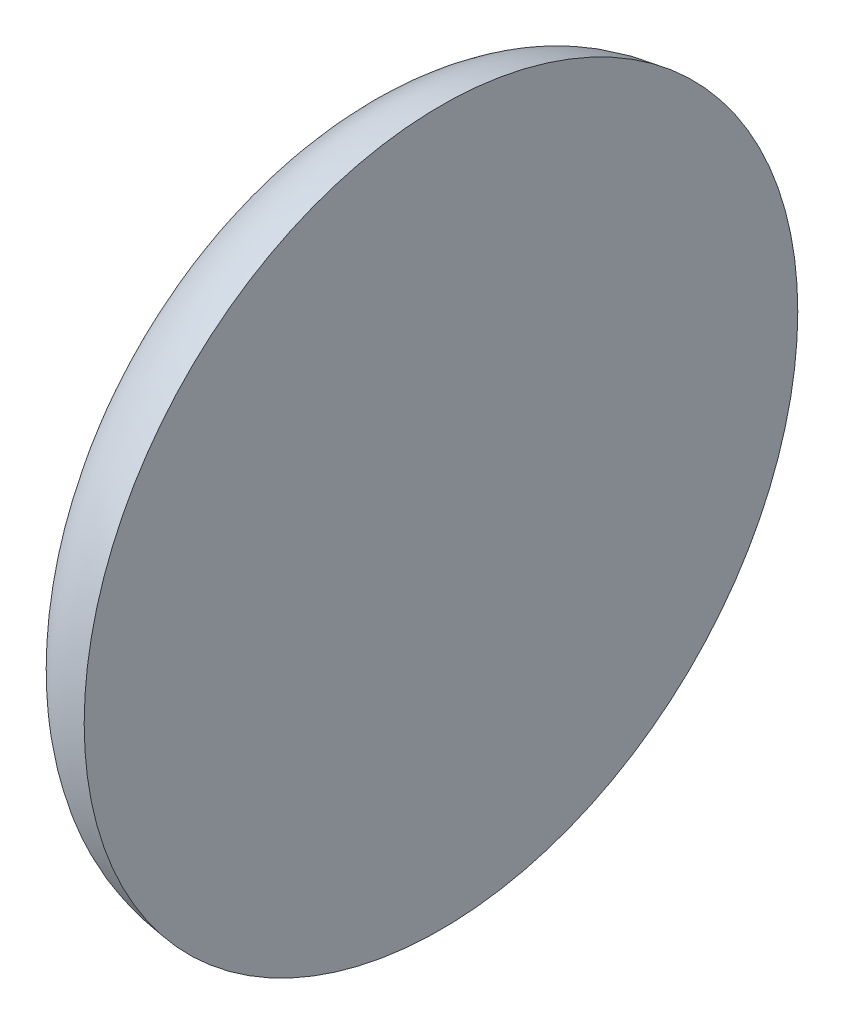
from build123d import *


with BuildPart() as part:
    # Sketch 2 → Revolve 1 (revolve)
    with BuildSketch(Plane(origin=(0, 0, 0), x_dir=(1, 0, 0), z_dir=(0, 1, 0))):
        with BuildLine():
            Line((7, 0), (7, 6))
            add(Edge.make_bspline(
                [(7, 6), (6.780882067, 5.97176481), (6.330367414, 5.913712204), (5.837659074, 5.514965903), (5.458177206, 4.973450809), (5.104402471, 4.160212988), (5.039833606, 3.442666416), (5, 3)],
                knots=[0, 0, 0, 0, 0.164642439, 0.338511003, 0.4580808, 0.665681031, 1, 1, 1, 1], degree=3))
            Line((5, 3), (5, 0))
            Line((5, 0), (7, 0))
        make_face()
    revolve(axis=Axis((0, 0, 0), (1, 0, 0)))


solid = part.part
